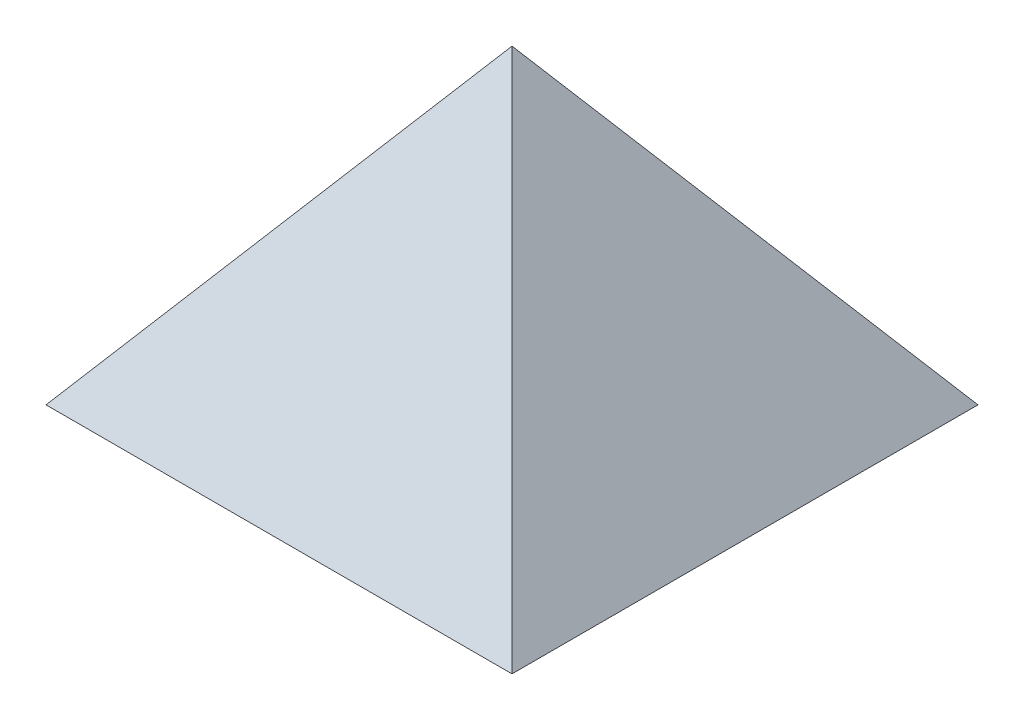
ISO-10303-21;
HEADER;
FILE_DESCRIPTION(('STEP AP214'),'2;1');
FILE_NAME('part.step','',(''),(''),'','','');
FILE_SCHEMA(('AUTOMOTIVE_DESIGN { 1 0 10303 214 1 1 1 1 }'));
ENDSEC;
DATA;
#1=APPLICATION_CONTEXT('core data for automotive mechanical design processes');
#2=APPLICATION_PROTOCOL_DEFINITION('international standard','automotive_design',2000,#1);
#3=PRODUCT_CONTEXT('',#1,'mechanical');
#4=PRODUCT('Part','Part','',(#3));
#5=PRODUCT_RELATED_PRODUCT_CATEGORY('part','',(#4));
#6=PRODUCT_DEFINITION_FORMATION('','',#4);
#7=PRODUCT_DEFINITION_CONTEXT('part definition',#1,'design');
#8=PRODUCT_DEFINITION('design','',#6,#7);
#9=PRODUCT_DEFINITION_SHAPE('','',#8);
#10=(LENGTH_UNIT() NAMED_UNIT(*) SI_UNIT(.MILLI.,.METRE.));
#11=(NAMED_UNIT(*) PLANE_ANGLE_UNIT() SI_UNIT($,.RADIAN.));
#12=(NAMED_UNIT(*) SI_UNIT($,.STERADIAN.) SOLID_ANGLE_UNIT());
#13=UNCERTAINTY_MEASURE_WITH_UNIT(LENGTH_MEASURE(1.E-05),#10,'distance_accuracy_value','');
#14=(GEOMETRIC_REPRESENTATION_CONTEXT(3) GLOBAL_UNCERTAINTY_ASSIGNED_CONTEXT((#13)) GLOBAL_UNIT_ASSIGNED_CONTEXT((#10,
#11,#12)) REPRESENTATION_CONTEXT('',''));
#15=CARTESIAN_POINT('',(0.,0.,0.));
#16=DIRECTION('',(0.,0.,1.));
#17=DIRECTION('',(1.,0.,0.));
#18=AXIS2_PLACEMENT_3D('',#15,#16,#17);
#19=CARTESIAN_POINT('',(0.,36.576,48.768));
#20=DIRECTION('',(0.,-0.6,-0.8));
#21=DIRECTION('',(0.,0.8,-0.6));
#22=AXIS2_PLACEMENT_3D('',#19,#20,#21);
#23=PLANE('',#22);
#24=DIRECTION('',(-0.514495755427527,0.685994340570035,-0.514495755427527));
#25=VECTOR('',#24,1.);
#26=CARTESIAN_POINT('',(76.2,0.,76.2));
#27=LINE('',#26,#25);
#28=CARTESIAN_POINT('',(76.2,0.,76.2));
#29=VERTEX_POINT('',#28);
#30=CARTESIAN_POINT('',(0.,101.6,0.));
#31=VERTEX_POINT('',#30);
#32=EDGE_CURVE('E64',#29,#31,#27,.T.);
#33=ORIENTED_EDGE('',*,*,#32,.T.);
#34=DIRECTION('',(0.514495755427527,0.685994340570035,-0.514495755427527));
#35=VECTOR('',#34,1.);
#36=CARTESIAN_POINT('',(-76.2,0.,76.2));
#37=LINE('',#36,#35);
#38=CARTESIAN_POINT('',(-76.2,0.,76.2));
#39=VERTEX_POINT('',#38);
#40=EDGE_CURVE('E81',#39,#31,#37,.T.);
#41=ORIENTED_EDGE('',*,*,#40,.F.);
#42=DIRECTION('',(1.,0.,0.));
#43=VECTOR('',#42,1.);
#44=CARTESIAN_POINT('',(-76.2,0.,76.2));
#45=LINE('',#44,#43);
#46=EDGE_CURVE('E12',#39,#29,#45,.T.);
#47=ORIENTED_EDGE('',*,*,#46,.T.);
#48=EDGE_LOOP('',(#33,#41,#47));
#49=FACE_BOUND('',#48,.T.);
#50=ADVANCED_FACE('F43',(#49),#23,.F.);
#51=CARTESIAN_POINT('',(0.,0.,0.));
#52=DIRECTION('',(0.,-1.,0.));
#53=DIRECTION('',(0.,0.,-1.));
#54=AXIS2_PLACEMENT_3D('',#51,#52,#53);
#55=PLANE('',#54);
#56=DIRECTION('',(0.,0.,-1.));
#57=VECTOR('',#56,1.);
#58=CARTESIAN_POINT('',(76.2,0.,76.2));
#59=LINE('',#58,#57);
#60=CARTESIAN_POINT('',(76.2,0.,-76.2));
#61=VERTEX_POINT('',#60);
#62=EDGE_CURVE('E96',#29,#61,#59,.T.);
#63=ORIENTED_EDGE('',*,*,#62,.F.);
#64=ORIENTED_EDGE('',*,*,#46,.F.);
#65=DIRECTION('',(0.,0.,1.));
#66=VECTOR('',#65,1.);
#67=CARTESIAN_POINT('',(-76.2,0.,76.2));
#68=LINE('',#67,#66);
#69=CARTESIAN_POINT('',(-76.2,0.,-76.2));
#70=VERTEX_POINT('',#69);
#71=EDGE_CURVE('E56',#70,#39,#68,.T.);
#72=ORIENTED_EDGE('',*,*,#71,.F.);
#73=DIRECTION('',(-1.,0.,0.));
#74=VECTOR('',#73,1.);
#75=CARTESIAN_POINT('',(-76.2,0.,-76.2));
#76=LINE('',#75,#74);
#77=EDGE_CURVE('E90',#61,#70,#76,.T.);
#78=ORIENTED_EDGE('',*,*,#77,.F.);
#79=EDGE_LOOP('',(#63,#64,#72,#78));
#80=FACE_BOUND('',#79,.T.);
#81=ADVANCED_FACE('F131',(#80),#55,.T.);
#82=CARTESIAN_POINT('',(-48.768,36.576,0.));
#83=DIRECTION('',(0.8,-0.6,0.));
#84=DIRECTION('',(0.6,0.8,0.));
#85=AXIS2_PLACEMENT_3D('',#82,#83,#84);
#86=PLANE('',#85);
#87=ORIENTED_EDGE('',*,*,#40,.T.);
#88=DIRECTION('',(0.514495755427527,0.685994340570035,0.514495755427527));
#89=VECTOR('',#88,1.);
#90=CARTESIAN_POINT('',(-76.2,0.,-76.2));
#91=LINE('',#90,#89);
#92=EDGE_CURVE('E89',#70,#31,#91,.T.);
#93=ORIENTED_EDGE('',*,*,#92,.F.);
#94=ORIENTED_EDGE('',*,*,#71,.T.);
#95=EDGE_LOOP('',(#87,#93,#94));
#96=FACE_BOUND('',#95,.T.);
#97=ADVANCED_FACE('F94',(#96),#86,.F.);
#98=CARTESIAN_POINT('',(48.768,36.576,0.));
#99=DIRECTION('',(-0.8,-0.6,0.));
#100=DIRECTION('',(0.6,-0.8,0.));
#101=AXIS2_PLACEMENT_3D('',#98,#99,#100);
#102=PLANE('',#101);
#103=DIRECTION('',(-0.514495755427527,0.685994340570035,0.514495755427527));
#104=VECTOR('',#103,1.);
#105=CARTESIAN_POINT('',(76.2,0.,-76.2));
#106=LINE('',#105,#104);
#107=EDGE_CURVE('E84',#61,#31,#106,.T.);
#108=ORIENTED_EDGE('',*,*,#107,.T.);
#109=ORIENTED_EDGE('',*,*,#32,.F.);
#110=ORIENTED_EDGE('',*,*,#62,.T.);
#111=EDGE_LOOP('',(#108,#109,#110));
#112=FACE_BOUND('',#111,.T.);
#113=ADVANCED_FACE('F98',(#112),#102,.F.);
#114=CARTESIAN_POINT('',(0.,36.576,-48.768));
#115=DIRECTION('',(0.,-0.6,0.8));
#116=DIRECTION('',(0.,-0.8,-0.6));
#117=AXIS2_PLACEMENT_3D('',#114,#115,#116);
#118=PLANE('',#117);
#119=ORIENTED_EDGE('',*,*,#92,.T.);
#120=ORIENTED_EDGE('',*,*,#107,.F.);
#121=ORIENTED_EDGE('',*,*,#77,.T.);
#122=EDGE_LOOP('',(#119,#120,#121));
#123=FACE_BOUND('',#122,.T.);
#124=ADVANCED_FACE('F45',(#123),#118,.F.);
#125=CLOSED_SHELL('',(#50,#81,#97,#113,#124));
#126=MANIFOLD_SOLID_BREP('B2',#125);
#127=ADVANCED_BREP_SHAPE_REPRESENTATION('',(#18,#126),#14);
#128=SHAPE_DEFINITION_REPRESENTATION(#9,#127);
ENDSEC;
END-ISO-10303-21;
